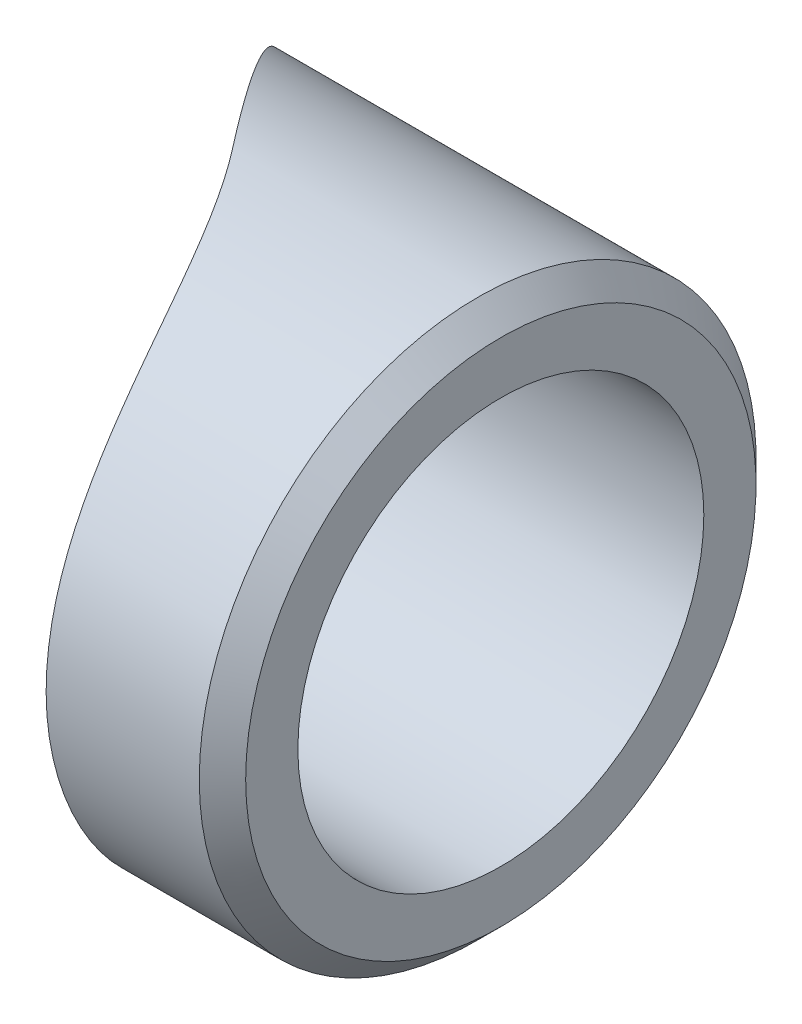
ISO-10303-21;
HEADER;
FILE_DESCRIPTION(('STEP AP214'),'2;1');
FILE_NAME('part.step','',(''),(''),'','','');
FILE_SCHEMA(('AUTOMOTIVE_DESIGN { 1 0 10303 214 1 1 1 1 }'));
ENDSEC;
DATA;
#1=APPLICATION_CONTEXT('core data for automotive mechanical design processes');
#2=APPLICATION_PROTOCOL_DEFINITION('international standard','automotive_design',2000,#1);
#3=PRODUCT_CONTEXT('',#1,'mechanical');
#4=PRODUCT('Part','Part','',(#3));
#5=PRODUCT_RELATED_PRODUCT_CATEGORY('part','',(#4));
#6=PRODUCT_DEFINITION_FORMATION('','',#4);
#7=PRODUCT_DEFINITION_CONTEXT('part definition',#1,'design');
#8=PRODUCT_DEFINITION('design','',#6,#7);
#9=PRODUCT_DEFINITION_SHAPE('','',#8);
#10=(LENGTH_UNIT() NAMED_UNIT(*) SI_UNIT(.MILLI.,.METRE.));
#11=(NAMED_UNIT(*) PLANE_ANGLE_UNIT() SI_UNIT($,.RADIAN.));
#12=(NAMED_UNIT(*) SI_UNIT($,.STERADIAN.) SOLID_ANGLE_UNIT());
#13=UNCERTAINTY_MEASURE_WITH_UNIT(LENGTH_MEASURE(1.E-05),#10,'distance_accuracy_value','');
#14=(GEOMETRIC_REPRESENTATION_CONTEXT(3) GLOBAL_UNCERTAINTY_ASSIGNED_CONTEXT((#13)) GLOBAL_UNIT_ASSIGNED_CONTEXT((#10,
#11,#12)) REPRESENTATION_CONTEXT('',''));
#15=CARTESIAN_POINT('',(0.,0.,0.));
#16=DIRECTION('',(0.,0.,1.));
#17=DIRECTION('',(1.,0.,0.));
#18=AXIS2_PLACEMENT_3D('',#15,#16,#17);
#19=CARTESIAN_POINT('',(-186.790266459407,0.,0.));
#20=DIRECTION('',(-1.,0.,0.));
#21=DIRECTION('',(0.,0.,1.));
#22=AXIS2_PLACEMENT_3D('',#19,#20,#21);
#23=CYLINDRICAL_SURFACE('',#22,12.);
#24=CARTESIAN_POINT('',(20.,0.,0.));
#25=DIRECTION('',(-1.,0.,0.));
#26=DIRECTION('',(0.,0.,1.));
#27=AXIS2_PLACEMENT_3D('',#24,#25,#26);
#28=CIRCLE('',#27,12.);
#29=CARTESIAN_POINT('',(20.,0.,12.));
#30=VERTEX_POINT('',#29);
#31=EDGE_CURVE('E81',#30,#30,#28,.T.);
#32=ORIENTED_EDGE('',*,*,#31,.T.);
#33=EDGE_LOOP('',(#32));
#34=FACE_BOUND('',#33,.T.);
#35=CARTESIAN_POINT('',(9.37542751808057,0.,0.));
#36=DIRECTION('',(-0.788010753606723,0.,0.615661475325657));
#37=DIRECTION('',(-0.615661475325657,0.,-0.788010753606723));
#38=AXIS2_PLACEMENT_3D('',#35,#36,#37);
#39=ELLIPSE('',#38,15.2282185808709,12.);
#40=CARTESIAN_POINT('',(9.16021507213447,11.996838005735,-0.275459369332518));
#41=VERTEX_POINT('',#40);
#42=CARTESIAN_POINT('',(9.16021507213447,-11.996838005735,-0.275459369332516));
#43=VERTEX_POINT('',#42);
#44=EDGE_CURVE('E69',#41,#43,#39,.T.);
#45=ORIENTED_EDGE('',*,*,#44,.F.);
#46=CARTESIAN_POINT('',(9.16021507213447,-11.996838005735,-0.275459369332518));
#47=CARTESIAN_POINT('',(9.26396914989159,-11.9998866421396,-0.14266178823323));
#48=CARTESIAN_POINT('',(9.36606000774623,-12.0007603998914,-0.00852926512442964));
#49=CARTESIAN_POINT('',(9.56680733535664,-11.9978983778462,0.262255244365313));
#50=CARTESIAN_POINT('',(9.66546341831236,-11.9941620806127,0.398907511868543));
#51=CARTESIAN_POINT('',(9.95620449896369,-11.9756402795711,0.812545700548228));
#52=CARTESIAN_POINT('',(10.1429320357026,-11.953537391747,1.09304621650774));
#53=CARTESIAN_POINT('',(10.5014941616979,-11.8877839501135,1.66220286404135));
#54=CARTESIAN_POINT('',(10.6732802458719,-11.8440660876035,1.95088179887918));
#55=CARTESIAN_POINT('',(11.0003245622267,-11.7333486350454,2.53303557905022));
#56=CARTESIAN_POINT('',(11.1555875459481,-11.6663557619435,2.82650901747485));
#57=CARTESIAN_POINT('',(11.4497529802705,-11.5072776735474,3.41710502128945));
#58=CARTESIAN_POINT('',(11.5885568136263,-11.4150511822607,3.71423885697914));
#59=CARTESIAN_POINT('',(11.8483902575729,-11.2047739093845,4.30720196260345));
#60=CARTESIAN_POINT('',(11.9694182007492,-11.0867207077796,4.60303110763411));
#61=CARTESIAN_POINT('',(12.1934481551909,-10.824793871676,5.18908457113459));
#62=CARTESIAN_POINT('',(12.2964935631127,-10.6809841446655,5.47932083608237));
#63=CARTESIAN_POINT('',(12.4854223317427,-10.36762436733,6.05133741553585));
#64=CARTESIAN_POINT('',(12.5713073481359,-10.1980768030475,6.33311854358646));
#65=CARTESIAN_POINT('',(12.7198516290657,-9.8505553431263,6.85980516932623));
#66=CARTESIAN_POINT('',(12.7839093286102,-9.67473228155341,7.10574019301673));
#67=CARTESIAN_POINT('',(12.8996660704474,-9.30344829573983,7.58536806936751));
#68=CARTESIAN_POINT('',(12.9513658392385,-9.10798852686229,7.81906164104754));
#69=CARTESIAN_POINT('',(13.0436863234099,-8.6984610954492,8.27225129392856));
#70=CARTESIAN_POINT('',(13.0842970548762,-8.48437689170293,8.49173444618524));
#71=CARTESIAN_POINT('',(13.1557687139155,-8.03915496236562,8.9143821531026));
#72=CARTESIAN_POINT('',(13.1866293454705,-7.80801671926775,9.11754621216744));
#73=CARTESIAN_POINT('',(13.2402559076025,-7.32852093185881,9.50730903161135));
#74=CARTESIAN_POINT('',(13.2629623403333,-7.08005201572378,9.69377886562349));
#75=CARTESIAN_POINT('',(13.3014777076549,-6.56904261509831,10.0470979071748));
#76=CARTESIAN_POINT('',(13.3172866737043,-6.30650219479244,10.2139472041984));
#77=CARTESIAN_POINT('',(13.343463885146,-5.76907912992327,10.5268419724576));
#78=CARTESIAN_POINT('',(13.3538325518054,-5.49419744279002,10.6728890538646));
#79=CARTESIAN_POINT('',(13.3704863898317,-4.93381459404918,10.9432291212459));
#80=CARTESIAN_POINT('',(13.3767713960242,-4.64831300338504,11.0675212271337));
#81=CARTESIAN_POINT('',(13.3867489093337,-4.0517545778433,11.3000701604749));
#82=CARTESIAN_POINT('',(13.3902711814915,-3.74017310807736,11.4069904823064));
#83=CARTESIAN_POINT('',(13.3953162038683,-3.10925724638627,11.5948638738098));
#84=CARTESIAN_POINT('',(13.3968388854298,-2.78992258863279,11.6758160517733));
#85=CARTESIAN_POINT('',(13.3988315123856,-2.14562447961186,11.811209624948));
#86=CARTESIAN_POINT('',(13.3993012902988,-1.82066014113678,11.8656468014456));
#87=CARTESIAN_POINT('',(13.3998388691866,-1.16735677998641,11.9476216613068));
#88=CARTESIAN_POINT('',(13.3999066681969,-0.839017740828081,11.9751592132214));
#89=CARTESIAN_POINT('',(13.3999759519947,-0.173497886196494,12.0034744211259));
#90=CARTESIAN_POINT('',(13.3999758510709,0.163710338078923,12.00361209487));
#91=CARTESIAN_POINT('',(13.3999079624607,0.836947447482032,11.9755180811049));
#92=CARTESIAN_POINT('',(13.3998401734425,1.17297630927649,11.9472858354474));
#93=CARTESIAN_POINT('',(13.3992779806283,1.84149895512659,11.8626477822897));
#94=CARTESIAN_POINT('',(13.3987835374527,2.1739924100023,11.8062393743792));
#95=CARTESIAN_POINT('',(13.3966612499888,2.83305073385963,11.6656484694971));
#96=CARTESIAN_POINT('',(13.395033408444,3.15961561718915,11.5814660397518));
#97=CARTESIAN_POINT('',(13.3896102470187,3.80491523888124,11.3858000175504));
#98=CARTESIAN_POINT('',(13.385812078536,4.1236391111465,11.2742806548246));
#99=CARTESIAN_POINT('',(13.3747212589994,4.75051339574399,11.0248094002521));
#100=CARTESIAN_POINT('',(13.3674285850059,5.05866373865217,10.8868573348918));
#101=CARTESIAN_POINT('',(13.3477780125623,5.66213697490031,10.5855536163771));
#102=CARTESIAN_POINT('',(13.3354199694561,5.95745950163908,10.422201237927));
#103=CARTESIAN_POINT('',(13.3038777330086,6.5330455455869,10.071390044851));
#104=CARTESIAN_POINT('',(13.2846936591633,6.81330932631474,9.88393165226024));
#105=CARTESIAN_POINT('',(13.2379275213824,7.35301644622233,9.48912267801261));
#106=CARTESIAN_POINT('',(13.2104600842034,7.61268643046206,9.28206853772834));
#107=CARTESIAN_POINT('',(13.1451935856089,8.11326603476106,8.84786304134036));
#108=CARTESIAN_POINT('',(13.1073945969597,8.35417578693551,8.62071182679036));
#109=CARTESIAN_POINT('',(13.0196896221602,8.81524385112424,8.14863608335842));
#110=CARTESIAN_POINT('',(12.9697904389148,9.03541372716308,7.90372159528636));
#111=CARTESIAN_POINT('',(12.8562277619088,9.4534989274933,7.39856937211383));
#112=CARTESIAN_POINT('',(12.7925650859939,9.65141557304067,7.13833254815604));
#113=CARTESIAN_POINT('',(12.6539514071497,10.0135670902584,6.61989282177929));
#114=CARTESIAN_POINT('',(12.5797994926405,10.1790462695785,6.36234451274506));
#115=CARTESIAN_POINT('',(12.4170493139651,10.4881142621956,5.83882246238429));
#116=CARTESIAN_POINT('',(12.3284515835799,10.6317038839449,5.57284903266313));
#117=CARTESIAN_POINT('',(12.1362436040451,10.8965858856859,5.03529593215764));
#118=CARTESIAN_POINT('',(12.0326335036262,11.0178784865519,4.76371631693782));
#119=CARTESIAN_POINT('',(11.8101831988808,11.2381873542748,4.21779431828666));
#120=CARTESIAN_POINT('',(11.6913433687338,11.3372041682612,3.94345200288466));
#121=CARTESIAN_POINT('',(11.4420140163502,11.5110036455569,3.40225836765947));
#122=CARTESIAN_POINT('',(11.3119322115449,11.5863752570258,3.13540746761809));
#123=CARTESIAN_POINT('',(11.0378366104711,11.7172565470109,2.60399535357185));
#124=CARTESIAN_POINT('',(10.8938218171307,11.7727648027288,2.33943430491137));
#125=CARTESIAN_POINT('',(10.5925193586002,11.8649633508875,1.81481746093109));
#126=CARTESIAN_POINT('',(10.4352373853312,11.9016616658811,1.55475979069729));
#127=CARTESIAN_POINT('',(10.1081042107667,11.9575660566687,1.04086200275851));
#128=CARTESIAN_POINT('',(9.93825701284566,11.9767776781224,0.787019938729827));
#129=CARTESIAN_POINT('',(9.66554294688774,11.9941602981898,0.399016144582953));
#130=CARTESIAN_POINT('',(9.5667592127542,11.9979017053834,0.262186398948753));
#131=CARTESIAN_POINT('',(9.36593723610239,12.0007595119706,-0.00869093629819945));
#132=CARTESIAN_POINT('',(9.26390588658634,11.9998851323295,-0.142743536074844));
#133=CARTESIAN_POINT('',(9.16021507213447,11.996838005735,-0.275459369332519));
#134=B_SPLINE_CURVE_WITH_KNOTS('',3,(#46,#47,#48,#49,#50,#51,#52,#53,#54,#55,#56,#57,#58,#59,
#60,#61,#62,#63,#64,#65,#66,#67,#68,#69,#70,#71,#72,#73,#74,#75,#76,#77,#78,#79,#80,#81,#82,#83,
#84,#85,#86,#87,#88,#89,#90,#91,#92,#93,#94,#95,#96,#97,#98,#99,#100,#101,#102,#103,#104,#105,
#106,#107,#108,#109,#110,#111,#112,#113,#114,#115,#116,#117,#118,#119,#120,#121,#122,#123,#124,
#125,#126,#127,#128,#129,#130,#131,#132,#133),.UNSPECIFIED.,.F.,.F.,(4,2,2,2,2,2,2,2,2,2,2,2,2,
2,2,2,2,2,2,2,2,2,2,2,2,2,2,2,2,2,2,2,2,2,2,2,2,2,2,2,2,2,2,4),(0.,0.505598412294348,
1.01125357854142,2.02319736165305,3.03831235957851,4.05313464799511,5.07375920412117,
6.09447943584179,7.11270126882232,8.13082481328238,9.0568182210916,9.98275717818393,
10.9095270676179,11.8363250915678,12.769754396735,13.7031794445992,14.6365322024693,
15.5699227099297,16.5570919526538,17.5442950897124,18.5316552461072,19.5190202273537,
20.5294445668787,21.5398887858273,22.5504262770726,23.5609613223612,24.5728257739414,
25.5846968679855,26.5965968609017,27.6084791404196,28.6069556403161,29.6054251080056,
30.6033345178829,31.601184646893,32.5449379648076,33.4886564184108,34.4323655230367,
35.3760514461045,36.2939169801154,37.2118482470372,38.1293876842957,39.0466360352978,
39.5529430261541,40.0582389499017),.UNSPECIFIED.);
#135=EDGE_CURVE('E57',#43,#41,#134,.T.);
#136=ORIENTED_EDGE('',*,*,#135,.F.);
#137=EDGE_LOOP('',(#45,#136));
#138=FACE_BOUND('',#137,.T.);
#139=ADVANCED_FACE('F36',(#34,#138),#23,.T.);
#140=CARTESIAN_POINT('',(21.,0.,0.));
#141=DIRECTION('',(1.,0.,0.));
#142=DIRECTION('',(0.,0.,-1.));
#143=AXIS2_PLACEMENT_3D('',#140,#141,#142);
#144=CYLINDRICAL_SURFACE('',#143,8.74999999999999);
#145=CARTESIAN_POINT('',(21.,0.,0.));
#146=DIRECTION('',(1.,0.,0.));
#147=DIRECTION('',(0.,0.,-1.));
#148=AXIS2_PLACEMENT_3D('',#145,#146,#147);
#149=CIRCLE('',#148,8.74999999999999);
#150=CARTESIAN_POINT('',(21.,0.,-8.74999999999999));
#151=VERTEX_POINT('',#150);
#152=EDGE_CURVE('E78',#151,#151,#149,.T.);
#153=ORIENTED_EDGE('',*,*,#152,.T.);
#154=EDGE_LOOP('',(#153));
#155=FACE_BOUND('',#154,.T.);
#156=CARTESIAN_POINT('',(9.16021507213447,8.74566304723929,-0.275459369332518));
#157=CARTESIAN_POINT('',(9.33162910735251,8.75258512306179,-0.0561271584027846));
#158=CARTESIAN_POINT('',(9.49858880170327,8.75134016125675,0.167077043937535));
#159=CARTESIAN_POINT('',(9.8228459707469,8.73095478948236,0.619919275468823));
#160=CARTESIAN_POINT('',(9.98013367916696,8.71179659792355,0.849563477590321));
#161=CARTESIAN_POINT('',(10.2847752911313,8.65384627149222,1.31479538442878));
#162=CARTESIAN_POINT('',(10.432070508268,8.61494790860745,1.55040862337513));
#163=CARTESIAN_POINT('',(10.7148681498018,8.51607963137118,2.02420960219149));
#164=CARTESIAN_POINT('',(10.8503742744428,8.45611635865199,2.26239650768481));
#165=CARTESIAN_POINT('',(11.1097690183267,8.31351864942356,2.74053705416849));
#166=CARTESIAN_POINT('',(11.2335748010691,8.23073677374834,2.98049195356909));
#167=CARTESIAN_POINT('',(11.4680294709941,8.04191604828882,3.45773529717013));
#168=CARTESIAN_POINT('',(11.5786769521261,7.93587471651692,3.69502345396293));
#169=CARTESIAN_POINT('',(11.7862278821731,7.70066619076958,4.16300360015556));
#170=CARTESIAN_POINT('',(11.8831743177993,7.57157433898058,4.39371432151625));
#171=CARTESIAN_POINT('',(12.0638347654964,7.29033751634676,4.84606792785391));
#172=CARTESIAN_POINT('',(12.1475509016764,7.13819625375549,5.06771226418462));
#173=CARTESIAN_POINT('',(12.2923278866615,6.83257916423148,5.47119744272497));
#174=CARTESIAN_POINT('',(12.3549166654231,6.68175581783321,5.65450633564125));
#175=CARTESIAN_POINT('',(12.4708791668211,6.36408925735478,6.00979502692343));
#176=CARTESIAN_POINT('',(12.5242536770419,6.19724741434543,6.18177579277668));
#177=CARTESIAN_POINT('',(12.6224686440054,5.84852249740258,6.51268864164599));
#178=CARTESIAN_POINT('',(12.6673025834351,5.66662808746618,6.67161070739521));
#179=CARTESIAN_POINT('',(12.7491355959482,5.28922216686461,6.97461020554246));
#180=CARTESIAN_POINT('',(12.7861346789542,5.09371067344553,7.11868765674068));
#181=CARTESIAN_POINT('',(12.851692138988,4.69901675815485,7.38484959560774));
#182=CARTESIAN_POINT('',(12.8805396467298,4.50033297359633,7.50760342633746));
#183=CARTESIAN_POINT('',(12.9324884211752,4.09320826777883,7.73710217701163));
#184=CARTESIAN_POINT('',(12.9555896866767,3.88476734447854,7.8438470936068));
#185=CARTESIAN_POINT('',(12.9967145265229,3.45963791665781,8.04041276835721));
#186=CARTESIAN_POINT('',(13.0147393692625,3.24295148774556,8.13023775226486));
#187=CARTESIAN_POINT('',(13.0463264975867,2.80277513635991,8.2922830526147));
#188=CARTESIAN_POINT('',(13.0598886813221,2.57928505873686,8.36450296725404));
#189=CARTESIAN_POINT('',(13.0832658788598,2.12308382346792,8.4918828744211));
#190=CARTESIAN_POINT('',(13.0930113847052,1.89027981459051,8.54672322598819));
#191=CARTESIAN_POINT('',(13.1088326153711,1.42084389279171,8.63717795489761));
#192=CARTESIAN_POINT('',(13.114908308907,1.18421194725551,8.67279216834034));
#193=CARTESIAN_POINT('',(13.12366908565,0.708728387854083,8.72452880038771));
#194=CARTESIAN_POINT('',(13.1263536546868,0.46987644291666,8.74064826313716));
#195=CARTESIAN_POINT('',(13.128458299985,-0.00835999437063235,8.75326503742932));
#196=CARTESIAN_POINT('',(13.1278783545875,-0.247744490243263,8.74976221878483));
#197=CARTESIAN_POINT('',(13.1233972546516,-0.728499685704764,8.72298676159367));
#198=CARTESIAN_POINT('',(13.119453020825,-0.969855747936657,8.69945769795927));
#199=CARTESIAN_POINT('',(13.1079954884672,-1.44970319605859,8.63247048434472));
#200=CARTESIAN_POINT('',(13.1004821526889,-1.68819455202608,8.5890121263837));
#201=CARTESIAN_POINT('',(13.0815402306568,-2.16060221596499,8.48250694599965));
#202=CARTESIAN_POINT('',(13.070111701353,-2.39451859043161,8.41946040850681));
#203=CARTESIAN_POINT('',(13.0428517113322,-2.85609013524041,8.27428416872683));
#204=CARTESIAN_POINT('',(13.0270202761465,-3.08374534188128,8.19215457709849));
#205=CARTESIAN_POINT('',(12.9903819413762,-3.53069397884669,8.00967225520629));
#206=CARTESIAN_POINT('',(12.9695848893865,-3.75000297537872,7.90935568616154));
#207=CARTESIAN_POINT('',(12.9223010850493,-4.17911942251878,7.69125385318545));
#208=CARTESIAN_POINT('',(12.8958143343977,-4.38892687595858,7.57346859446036));
#209=CARTESIAN_POINT('',(12.8363956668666,-4.79748255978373,7.32149302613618));
#210=CARTESIAN_POINT('',(12.8034639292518,-4.99623109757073,7.18730317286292));
#211=CARTESIAN_POINT('',(12.7303805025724,-5.38120840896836,6.90378441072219));
#212=CARTESIAN_POINT('',(12.690228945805,-5.56743741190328,6.75445577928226));
#213=CARTESIAN_POINT('',(12.6027041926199,-5.92300733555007,6.44477509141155));
#214=CARTESIAN_POINT('',(12.5554643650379,-6.0925802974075,6.2846517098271));
#215=CARTESIAN_POINT('',(12.4526437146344,-6.41721252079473,5.95279425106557));
#216=CARTESIAN_POINT('',(12.3970630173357,-6.57227200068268,5.78106034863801));
#217=CARTESIAN_POINT('',(12.2770738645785,-6.86684893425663,5.42786593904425));
#218=CARTESIAN_POINT('',(12.212671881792,-7.00637764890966,5.24641262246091));
#219=CARTESIAN_POINT('',(12.0746249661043,-7.26933777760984,4.8755411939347));
#220=CARTESIAN_POINT('',(12.0009801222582,-7.39276934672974,4.68612315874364));
#221=CARTESIAN_POINT('',(11.8450913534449,-7.62185303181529,4.30337742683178));
#222=CARTESIAN_POINT('',(11.7629505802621,-7.72768527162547,4.11011538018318));
#223=CARTESIAN_POINT('',(11.5893764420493,-7.9230600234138,3.71958267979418));
#224=CARTESIAN_POINT('',(11.4979430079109,-8.01260241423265,3.5223119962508));
#225=CARTESIAN_POINT('',(11.305746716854,-8.17566127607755,3.12525288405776));
#226=CARTESIAN_POINT('',(11.2049684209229,-8.24915052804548,2.92546077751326));
#227=CARTESIAN_POINT('',(10.9944751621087,-8.38029095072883,2.52538100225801));
#228=CARTESIAN_POINT('',(10.8847593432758,-8.43794060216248,2.32509328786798));
#229=CARTESIAN_POINT('',(10.6530279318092,-8.53962393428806,1.91900245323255));
#230=CARTESIAN_POINT('',(10.5307261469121,-8.58314626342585,1.71323510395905));
#231=CARTESIAN_POINT('',(10.2775070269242,-8.65473506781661,1.30428825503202));
#232=CARTESIAN_POINT('',(10.1465877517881,-8.68279804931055,1.10110935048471));
#233=CARTESIAN_POINT('',(9.87724973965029,-8.72433083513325,0.699408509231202));
#234=CARTESIAN_POINT('',(9.73886099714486,-8.73785502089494,0.500871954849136));
#235=CARTESIAN_POINT('',(9.45483807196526,-8.75152271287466,0.10877263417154));
#236=CARTESIAN_POINT('',(9.30920887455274,-8.75167530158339,-0.0847934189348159));
#237=CARTESIAN_POINT('',(9.16021507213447,-8.74566304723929,-0.275459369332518));
#238=B_SPLINE_CURVE_WITH_KNOTS('',3,(#156,#157,#158,#159,#160,#161,#162,#163,#164,#165,#166,
#167,#168,#169,#170,#171,#172,#173,#174,#175,#176,#177,#178,#179,#180,#181,#182,#183,#184,#185,
#186,#187,#188,#189,#190,#191,#192,#193,#194,#195,#196,#197,#198,#199,#200,#201,#202,#203,#204,
#205,#206,#207,#208,#209,#210,#211,#212,#213,#214,#215,#216,#217,#218,#219,#220,#221,#222,#223,
#224,#225,#226,#227,#228,#229,#230,#231,#232,#233,#234,#235,#236,#237),.UNSPECIFIED.,.F.,.F.,(4,
2,2,2,2,2,2,2,2,2,2,2,2,2,2,2,2,2,2,2,2,2,2,2,2,2,2,2,2,2,2,2,2,2,2,2,2,2,2,2,4),(0.,
0.835341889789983,1.67151386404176,2.51223402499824,3.3526893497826,4.19870787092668,
5.04481671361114,5.88820899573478,6.73146573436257,7.46701666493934,8.20250469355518,
8.9385517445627,9.67459786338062,10.3797455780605,11.0848934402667,11.7898649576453,
12.4948525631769,13.2121405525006,13.9294346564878,14.6468375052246,15.3642451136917,
16.0909793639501,16.8177211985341,17.5444524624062,18.2711795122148,18.9964771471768,
19.7217745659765,20.4470518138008,21.1723157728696,21.885334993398,22.5983434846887,
23.310831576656,24.0233128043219,24.7279810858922,25.4326546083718,26.1385138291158,
26.8444407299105,27.5736325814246,28.3029891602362,29.0296080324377,29.7557333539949),.UNSPECIFIED.);
#239=CARTESIAN_POINT('',(9.16021507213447,8.74566304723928,-0.275459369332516));
#240=VERTEX_POINT('',#239);
#241=CARTESIAN_POINT('',(9.16021507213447,-8.74566304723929,-0.275459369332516));
#242=VERTEX_POINT('',#241);
#243=EDGE_CURVE('E11',#240,#242,#238,.T.);
#244=ORIENTED_EDGE('',*,*,#243,.F.);
#245=CARTESIAN_POINT('',(9.37542751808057,0.,0.));
#246=DIRECTION('',(-0.788010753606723,0.,0.615661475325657));
#247=DIRECTION('',(0.615661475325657,0.,0.788010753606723));
#248=AXIS2_PLACEMENT_3D('',#245,#246,#247);
#249=ELLIPSE('',#248,11.103909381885,8.74999999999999);
#250=EDGE_CURVE('E50',#242,#240,#249,.F.);
#251=ORIENTED_EDGE('',*,*,#250,.F.);
#252=EDGE_LOOP('',(#244,#251));
#253=FACE_BOUND('',#252,.T.);
#254=ADVANCED_FACE('F93',(#155,#253),#144,.F.);
#255=CARTESIAN_POINT('',(21.,0.,0.));
#256=DIRECTION('',(-1.,0.,0.));
#257=DIRECTION('',(0.,0.,1.));
#258=AXIS2_PLACEMENT_3D('',#255,#256,#257);
#259=PLANE('',#258);
#260=CARTESIAN_POINT('',(21.,0.,0.));
#261=DIRECTION('',(-1.,0.,0.));
#262=DIRECTION('',(0.,0.,1.));
#263=AXIS2_PLACEMENT_3D('',#260,#261,#262);
#264=CIRCLE('',#263,11.);
#265=CARTESIAN_POINT('',(21.,0.,11.));
#266=VERTEX_POINT('',#265);
#267=EDGE_CURVE('E114',#266,#266,#264,.F.);
#268=ORIENTED_EDGE('',*,*,#267,.T.);
#269=EDGE_LOOP('',(#268));
#270=FACE_BOUND('',#269,.T.);
#271=ORIENTED_EDGE('',*,*,#152,.F.);
#272=EDGE_LOOP('',(#271));
#273=FACE_BOUND('',#272,.T.);
#274=ADVANCED_FACE('F97',(#270,#273),#259,.F.);
#275=CARTESIAN_POINT('',(20.,0.,0.));
#276=DIRECTION('',(-1.,0.,0.));
#277=DIRECTION('',(0.,0.,1.));
#278=AXIS2_PLACEMENT_3D('',#275,#276,#277);
#279=CONICAL_SURFACE('',#278,12.,0.785398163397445);
#280=ORIENTED_EDGE('',*,*,#267,.F.);
#281=EDGE_LOOP('',(#280));
#282=FACE_BOUND('',#281,.T.);
#283=ORIENTED_EDGE('',*,*,#31,.F.);
#284=EDGE_LOOP('',(#283));
#285=FACE_BOUND('',#284,.T.);
#286=ADVANCED_FACE('F38',(#282,#285),#279,.T.);
#287=CARTESIAN_POINT('',(-6.59999999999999,-12.,12.0377701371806));
#288=DIRECTION('',(0.,1.,0.));
#289=DIRECTION('',(0.,0.,1.));
#290=AXIS2_PLACEMENT_3D('',#287,#288,#289);
#291=CYLINDRICAL_SURFACE('',#290,20.);
#292=ORIENTED_EDGE('',*,*,#135,.T.);
#293=DIRECTION('',(0.,1.,0.));
#294=VECTOR('',#293,1.);
#295=CARTESIAN_POINT('',(9.16021507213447,-12.,-0.275459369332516));
#296=LINE('',#295,#294);
#297=EDGE_CURVE('E71',#240,#41,#296,.T.);
#298=ORIENTED_EDGE('',*,*,#297,.F.);
#299=ORIENTED_EDGE('',*,*,#243,.T.);
#300=EDGE_CURVE('E64',#43,#242,#296,.T.);
#301=ORIENTED_EDGE('',*,*,#300,.F.);
#302=EDGE_LOOP('',(#292,#298,#299,#301));
#303=FACE_BOUND('',#302,.T.);
#304=ADVANCED_FACE('F74',(#303),#291,.F.);
#305=CARTESIAN_POINT('',(5.82177435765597,-12.,-4.54846862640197));
#306=DIRECTION('',(-0.788010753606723,0.,0.615661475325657));
#307=DIRECTION('',(0.615661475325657,0.,0.788010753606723));
#308=AXIS2_PLACEMENT_3D('',#305,#306,#307);
#309=PLANE('',#308);
#310=ORIENTED_EDGE('',*,*,#44,.T.);
#311=ORIENTED_EDGE('',*,*,#300,.T.);
#312=ORIENTED_EDGE('',*,*,#250,.T.);
#313=ORIENTED_EDGE('',*,*,#297,.T.);
#314=EDGE_LOOP('',(#310,#311,#312,#313));
#315=FACE_BOUND('',#314,.T.);
#316=ADVANCED_FACE('F70',(#315),#309,.T.);
#317=CLOSED_SHELL('',(#139,#254,#274,#286,#304,#316));
#318=MANIFOLD_SOLID_BREP('B2',#317);
#319=ADVANCED_BREP_SHAPE_REPRESENTATION('',(#18,#318),#14);
#320=SHAPE_DEFINITION_REPRESENTATION(#9,#319);
ENDSEC;
END-ISO-10303-21;
